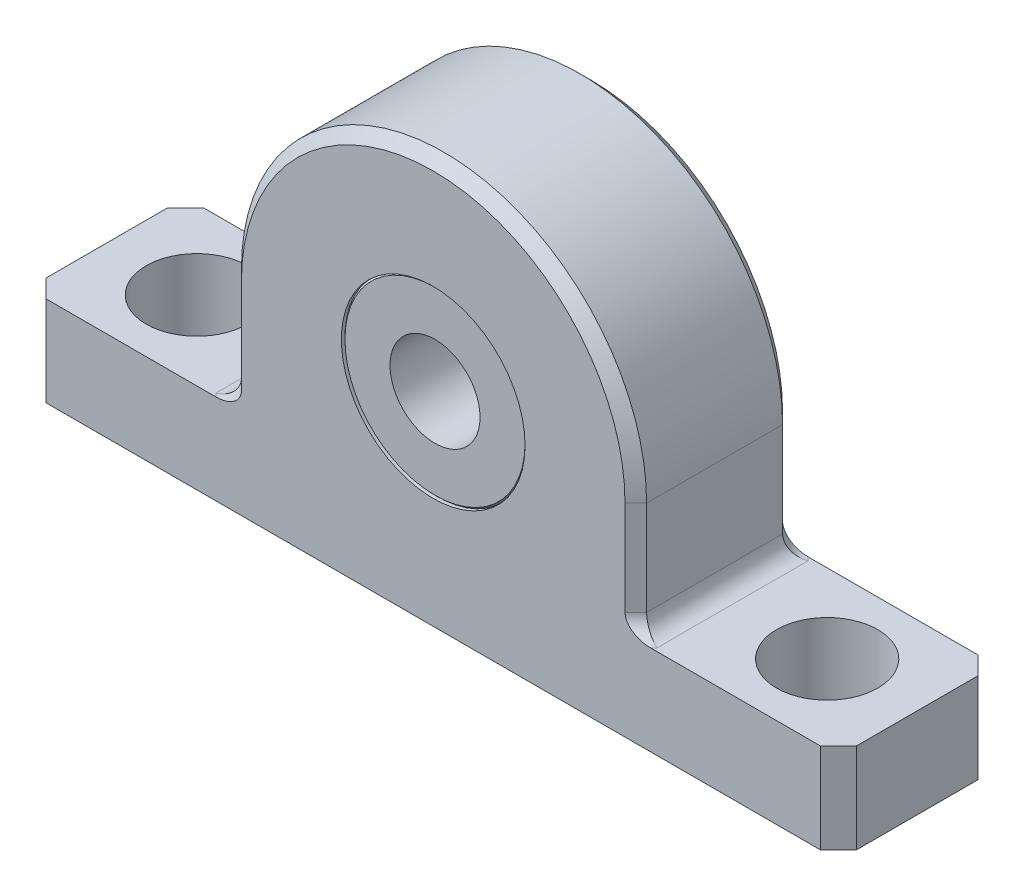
ISO-10303-21;
HEADER;
FILE_DESCRIPTION(('STEP AP214'),'2;1');
FILE_NAME('part.step','',(''),(''),'','','');
FILE_SCHEMA(('AUTOMOTIVE_DESIGN { 1 0 10303 214 1 1 1 1 }'));
ENDSEC;
DATA;
#1=APPLICATION_CONTEXT('core data for automotive mechanical design processes');
#2=APPLICATION_PROTOCOL_DEFINITION('international standard','automotive_design',2000,#1);
#3=PRODUCT_CONTEXT('',#1,'mechanical');
#4=PRODUCT('Part','Part','',(#3));
#5=PRODUCT_RELATED_PRODUCT_CATEGORY('part','',(#4));
#6=PRODUCT_DEFINITION_FORMATION('','',#4);
#7=PRODUCT_DEFINITION_CONTEXT('part definition',#1,'design');
#8=PRODUCT_DEFINITION('design','',#6,#7);
#9=PRODUCT_DEFINITION_SHAPE('','',#8);
#10=(LENGTH_UNIT() NAMED_UNIT(*) SI_UNIT(.MILLI.,.METRE.));
#11=(NAMED_UNIT(*) PLANE_ANGLE_UNIT() SI_UNIT($,.RADIAN.));
#12=(NAMED_UNIT(*) SI_UNIT($,.STERADIAN.) SOLID_ANGLE_UNIT());
#13=UNCERTAINTY_MEASURE_WITH_UNIT(LENGTH_MEASURE(1.E-05),#10,'distance_accuracy_value','');
#14=(GEOMETRIC_REPRESENTATION_CONTEXT(3) GLOBAL_UNCERTAINTY_ASSIGNED_CONTEXT((#13)) GLOBAL_UNIT_ASSIGNED_CONTEXT((#10,
#11,#12)) REPRESENTATION_CONTEXT('',''));
#15=CARTESIAN_POINT('',(0.,0.,0.));
#16=DIRECTION('',(0.,0.,1.));
#17=DIRECTION('',(1.,0.,0.));
#18=AXIS2_PLACEMENT_3D('',#15,#16,#17);
#19=CARTESIAN_POINT('',(0.,0.,-5.55625));
#20=DIRECTION('',(0.,0.,1.));
#21=DIRECTION('',(1.,0.,0.));
#22=AXIS2_PLACEMENT_3D('',#19,#20,#21);
#23=CYLINDRICAL_SURFACE('',#22,6.477);
#24=CARTESIAN_POINT('',(0.,0.,5.55625));
#25=DIRECTION('',(0.,0.,1.));
#26=DIRECTION('',(1.,0.,0.));
#27=AXIS2_PLACEMENT_3D('',#24,#25,#26);
#28=CIRCLE('',#27,6.477);
#29=CARTESIAN_POINT('',(6.477,0.,5.55625));
#30=VERTEX_POINT('',#29);
#31=EDGE_CURVE('E363',#30,#30,#28,.T.);
#32=ORIENTED_EDGE('',*,*,#31,.T.);
#33=EDGE_LOOP('',(#32));
#34=FACE_BOUND('',#33,.T.);
#35=CARTESIAN_POINT('',(0.,0.,5.30224999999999));
#36=DIRECTION('',(0.,0.,-1.));
#37=DIRECTION('',(0.,1.,0.));
#38=AXIS2_PLACEMENT_3D('',#35,#36,#37);
#39=CIRCLE('',#38,6.477);
#40=CARTESIAN_POINT('',(0.,6.477,5.30224999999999));
#41=VERTEX_POINT('',#40);
#42=EDGE_CURVE('E11',#41,#41,#39,.F.);
#43=ORIENTED_EDGE('',*,*,#42,.F.);
#44=EDGE_LOOP('',(#43));
#45=FACE_BOUND('',#44,.T.);
#46=ADVANCED_FACE('F33',(#34,#45),#23,.F.);
#47=CARTESIAN_POINT('',(0.,0.,-5.55625));
#48=DIRECTION('',(0.,0.,1.));
#49=DIRECTION('',(1.,0.,0.));
#50=AXIS2_PLACEMENT_3D('',#47,#48,#49);
#51=CIRCLE('',#50,6.477);
#52=CARTESIAN_POINT('',(6.477,0.,-5.55625));
#53=VERTEX_POINT('',#52);
#54=EDGE_CURVE('E366',#53,#53,#51,.T.);
#55=ORIENTED_EDGE('',*,*,#54,.F.);
#56=EDGE_LOOP('',(#55));
#57=FACE_BOUND('',#56,.T.);
#58=CARTESIAN_POINT('',(0.,0.,4.15925));
#59=DIRECTION('',(0.,0.,1.));
#60=DIRECTION('',(0.,-1.,0.));
#61=AXIS2_PLACEMENT_3D('',#58,#59,#60);
#62=CIRCLE('',#61,6.477);
#63=CARTESIAN_POINT('',(0.,-6.477,4.15925));
#64=VERTEX_POINT('',#63);
#65=EDGE_CURVE('E42',#64,#64,#62,.F.);
#66=ORIENTED_EDGE('',*,*,#65,.F.);
#67=EDGE_LOOP('',(#66));
#68=FACE_BOUND('',#67,.T.);
#69=ADVANCED_FACE('F437',(#57,#68),#23,.F.);
#70=CARTESIAN_POINT('',(0.,0.,5.55625));
#71=DIRECTION('',(0.,0.,-1.));
#72=DIRECTION('',(-1.,0.,0.));
#73=AXIS2_PLACEMENT_3D('',#70,#71,#72);
#74=CYLINDRICAL_SURFACE('',#73,14.2875);
#75=DIRECTION('',(0.,0.,-1.));
#76=VECTOR('',#75,1.);
#77=CARTESIAN_POINT('',(14.2875,0.,5.55625));
#78=LINE('',#77,#76);
#79=CARTESIAN_POINT('',(14.2875,0.,4.79424999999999));
#80=VERTEX_POINT('',#79);
#81=CARTESIAN_POINT('',(14.2875,0.,-4.79425));
#82=VERTEX_POINT('',#81);
#83=EDGE_CURVE('E240',#80,#82,#78,.T.);
#84=ORIENTED_EDGE('',*,*,#83,.T.);
#85=CARTESIAN_POINT('',(0.,0.,-4.79425));
#86=DIRECTION('',(0.,0.,1.));
#87=DIRECTION('',(1.,0.,0.));
#88=AXIS2_PLACEMENT_3D('',#85,#86,#87);
#89=CIRCLE('',#88,14.2875);
#90=CARTESIAN_POINT('',(-14.2875,0.,-4.79425));
#91=VERTEX_POINT('',#90);
#92=EDGE_CURVE('E193',#82,#91,#89,.T.);
#93=ORIENTED_EDGE('',*,*,#92,.T.);
#94=DIRECTION('',(0.,0.,-1.));
#95=VECTOR('',#94,1.);
#96=CARTESIAN_POINT('',(-14.2875,0.,5.55625));
#97=LINE('',#96,#95);
#98=CARTESIAN_POINT('',(-14.2875,0.,4.79424999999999));
#99=VERTEX_POINT('',#98);
#100=EDGE_CURVE('E178',#99,#91,#97,.T.);
#101=ORIENTED_EDGE('',*,*,#100,.F.);
#102=CARTESIAN_POINT('',(0.,0.,4.79424999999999));
#103=DIRECTION('',(0.,0.,1.));
#104=DIRECTION('',(1.,0.,0.));
#105=AXIS2_PLACEMENT_3D('',#102,#103,#104);
#106=CIRCLE('',#105,14.2875);
#107=EDGE_CURVE('E190',#99,#80,#106,.F.);
#108=ORIENTED_EDGE('',*,*,#107,.T.);
#109=EDGE_LOOP('',(#84,#93,#101,#108));
#110=FACE_BOUND('',#109,.T.);
#111=ADVANCED_FACE('F35',(#110),#74,.T.);
#112=CARTESIAN_POINT('',(-14.2875,0.,5.55625));
#113=DIRECTION('',(1.,0.,0.));
#114=DIRECTION('',(0.,1.,0.));
#115=AXIS2_PLACEMENT_3D('',#112,#113,#114);
#116=PLANE('',#115);
#117=DIRECTION('',(0.,-1.,0.));
#118=VECTOR('',#117,1.);
#119=CARTESIAN_POINT('',(-14.2875,0.,-4.79425));
#120=LINE('',#119,#118);
#121=CARTESIAN_POINT('',(-14.2875,-6.6675,-4.79425));
#122=VERTEX_POINT('',#121);
#123=EDGE_CURVE('E185',#91,#122,#120,.T.);
#124=ORIENTED_EDGE('',*,*,#123,.T.);
#125=DIRECTION('',(0.,0.,-1.));
#126=VECTOR('',#125,1.);
#127=CARTESIAN_POINT('',(-14.2875,-6.6675,4.79424999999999));
#128=LINE('',#127,#126);
#129=CARTESIAN_POINT('',(-14.2875,-6.6675,4.79424999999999));
#130=VERTEX_POINT('',#129);
#131=EDGE_CURVE('E181',#122,#130,#128,.F.);
#132=ORIENTED_EDGE('',*,*,#131,.T.);
#133=DIRECTION('',(0.,1.,0.));
#134=VECTOR('',#133,1.);
#135=CARTESIAN_POINT('',(-14.2875,0.,4.79424999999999));
#136=LINE('',#135,#134);
#137=EDGE_CURVE('E174',#130,#99,#136,.T.);
#138=ORIENTED_EDGE('',*,*,#137,.T.);
#139=ORIENTED_EDGE('',*,*,#100,.T.);
#140=EDGE_LOOP('',(#124,#132,#138,#139));
#141=FACE_BOUND('',#140,.T.);
#142=ADVANCED_FACE('F177',(#141),#116,.F.);
#143=CARTESIAN_POINT('',(-14.2875,-7.9375,5.55625));
#144=DIRECTION('',(0.,-1.,0.));
#145=DIRECTION('',(1.,0.,0.));
#146=AXIS2_PLACEMENT_3D('',#143,#144,#145);
#147=PLANE('',#146);
#148=CARTESIAN_POINT('',(-22.225,-7.9375,0.));
#149=DIRECTION('',(0.,-1.,0.));
#150=DIRECTION('',(1.,0.,0.));
#151=AXIS2_PLACEMENT_3D('',#148,#149,#150);
#152=CIRCLE('',#151,3.571875);
#153=CARTESIAN_POINT('',(-22.225,-7.9375,3.571875));
#154=VERTEX_POINT('',#153);
#155=EDGE_CURVE('E349',#154,#154,#152,.T.);
#156=ORIENTED_EDGE('',*,*,#155,.T.);
#157=EDGE_LOOP('',(#156));
#158=FACE_BOUND('',#157,.T.);
#159=DIRECTION('',(-1.,0.,0.));
#160=VECTOR('',#159,1.);
#161=CARTESIAN_POINT('',(-14.2875,-7.9375,-5.55625));
#162=LINE('',#161,#160);
#163=CARTESIAN_POINT('',(-15.3215512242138,-7.9375,-5.55625));
#164=VERTEX_POINT('',#163);
#165=CARTESIAN_POINT('',(-27.305,-7.9375,-5.55625));
#166=VERTEX_POINT('',#165);
#167=EDGE_CURVE('E224',#164,#166,#162,.T.);
#168=ORIENTED_EDGE('',*,*,#167,.T.);
#169=DIRECTION('',(0.707106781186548,0.,-0.707106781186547));
#170=VECTOR('',#169,1.);
#171=CARTESIAN_POINT('',(-28.575,-7.9375,-4.28625));
#172=LINE('',#171,#170);
#173=CARTESIAN_POINT('',(-28.575,-7.9375,-4.28625));
#174=VERTEX_POINT('',#173);
#175=EDGE_CURVE('E324',#166,#174,#172,.F.);
#176=ORIENTED_EDGE('',*,*,#175,.T.);
#177=DIRECTION('',(0.,0.,-1.));
#178=VECTOR('',#177,1.);
#179=CARTESIAN_POINT('',(-28.575,-7.9375,5.55625));
#180=LINE('',#179,#178);
#181=CARTESIAN_POINT('',(-28.575,-7.9375,4.28625));
#182=VERTEX_POINT('',#181);
#183=EDGE_CURVE('E194',#182,#174,#180,.T.);
#184=ORIENTED_EDGE('',*,*,#183,.F.);
#185=DIRECTION('',(0.707106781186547,0.,0.707106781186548));
#186=VECTOR('',#185,1.);
#187=CARTESIAN_POINT('',(-27.305,-7.9375,5.55625));
#188=LINE('',#187,#186);
#189=CARTESIAN_POINT('',(-27.305,-7.9375,5.55625));
#190=VERTEX_POINT('',#189);
#191=EDGE_CURVE('E322',#182,#190,#188,.T.);
#192=ORIENTED_EDGE('',*,*,#191,.T.);
#193=DIRECTION('',(-1.,0.,0.));
#194=VECTOR('',#193,1.);
#195=CARTESIAN_POINT('',(-14.2875,-7.9375,5.55625));
#196=LINE('',#195,#194);
#197=CARTESIAN_POINT('',(-15.3215512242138,-7.9375,5.55625));
#198=VERTEX_POINT('',#197);
#199=EDGE_CURVE('E232',#198,#190,#196,.T.);
#200=ORIENTED_EDGE('',*,*,#199,.F.);
#201=DIRECTION('',(-0.707106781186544,0.,-0.707106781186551));
#202=VECTOR('',#201,1.);
#203=CARTESIAN_POINT('',(-14.8045256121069,-7.9375,6.07327561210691));
#204=LINE('',#203,#202);
#205=CARTESIAN_POINT('',(-15.5575,-7.9375,5.32030122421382));
#206=VERTEX_POINT('',#205);
#207=EDGE_CURVE('E272',#198,#206,#204,.T.);
#208=ORIENTED_EDGE('',*,*,#207,.T.);
#209=DIRECTION('',(0.,0.,-1.));
#210=VECTOR('',#209,1.);
#211=CARTESIAN_POINT('',(-15.5575,-7.9375,-4.79425));
#212=LINE('',#211,#210);
#213=CARTESIAN_POINT('',(-15.5575,-7.9375,-5.32030122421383));
#214=VERTEX_POINT('',#213);
#215=EDGE_CURVE('E270',#206,#214,#212,.T.);
#216=ORIENTED_EDGE('',*,*,#215,.T.);
#217=DIRECTION('',(-0.707106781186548,0.,0.707106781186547));
#218=VECTOR('',#217,1.);
#219=CARTESIAN_POINT('',(-20.3607756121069,-7.9375,-0.517025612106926));
#220=LINE('',#219,#218);
#221=EDGE_CURVE('E274',#214,#164,#220,.F.);
#222=ORIENTED_EDGE('',*,*,#221,.T.);
#223=EDGE_LOOP('',(#168,#176,#184,#192,#200,#208,#216,#222));
#224=FACE_BOUND('',#223,.T.);
#225=ADVANCED_FACE('F717',(#158,#224),#147,.F.);
#226=CARTESIAN_POINT('',(-28.575,-7.9375,5.55625));
#227=DIRECTION('',(1.,0.,0.));
#228=DIRECTION('',(0.,1.,0.));
#229=AXIS2_PLACEMENT_3D('',#226,#227,#228);
#230=PLANE('',#229);
#231=ORIENTED_EDGE('',*,*,#183,.T.);
#232=DIRECTION('',(0.,-1.,0.));
#233=VECTOR('',#232,1.);
#234=CARTESIAN_POINT('',(-28.575,-7.9375,-4.28625));
#235=LINE('',#234,#233);
#236=CARTESIAN_POINT('',(-28.575,-14.2875,-4.28625));
#237=VERTEX_POINT('',#236);
#238=EDGE_CURVE('E307',#174,#237,#235,.T.);
#239=ORIENTED_EDGE('',*,*,#238,.T.);
#240=DIRECTION('',(0.,0.,-1.));
#241=VECTOR('',#240,1.);
#242=CARTESIAN_POINT('',(-28.575,-14.2875,5.55625));
#243=LINE('',#242,#241);
#244=CARTESIAN_POINT('',(-28.575,-14.2875,4.28625));
#245=VERTEX_POINT('',#244);
#246=EDGE_CURVE('E247',#245,#237,#243,.T.);
#247=ORIENTED_EDGE('',*,*,#246,.F.);
#248=DIRECTION('',(0.,1.,0.));
#249=VECTOR('',#248,1.);
#250=CARTESIAN_POINT('',(-28.575,-7.9375,4.28625));
#251=LINE('',#250,#249);
#252=EDGE_CURVE('E305',#245,#182,#251,.T.);
#253=ORIENTED_EDGE('',*,*,#252,.T.);
#254=EDGE_LOOP('',(#231,#239,#247,#253));
#255=FACE_BOUND('',#254,.T.);
#256=ADVANCED_FACE('F709',(#255),#230,.F.);
#257=CARTESIAN_POINT('',(-28.575,-14.2875,5.55625));
#258=DIRECTION('',(0.,1.,0.));
#259=DIRECTION('',(-1.,0.,0.));
#260=AXIS2_PLACEMENT_3D('',#257,#258,#259);
#261=PLANE('',#260);
#262=CARTESIAN_POINT('',(22.225,-14.2875,0.));
#263=DIRECTION('',(0.,1.,0.));
#264=DIRECTION('',(0.,0.,1.));
#265=AXIS2_PLACEMENT_3D('',#262,#263,#264);
#266=CIRCLE('',#265,3.571875);
#267=CARTESIAN_POINT('',(22.225,-14.2875,3.57187499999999));
#268=VERTEX_POINT('',#267);
#269=EDGE_CURVE('E772',#268,#268,#266,.T.);
#270=ORIENTED_EDGE('',*,*,#269,.T.);
#271=EDGE_LOOP('',(#270));
#272=FACE_BOUND('',#271,.T.);
#273=CARTESIAN_POINT('',(-22.225,-14.2875,0.));
#274=DIRECTION('',(0.,1.,0.));
#275=DIRECTION('',(0.,0.,1.));
#276=AXIS2_PLACEMENT_3D('',#273,#274,#275);
#277=CIRCLE('',#276,3.571875);
#278=CARTESIAN_POINT('',(-22.225,-14.2875,3.571875));
#279=VERTEX_POINT('',#278);
#280=EDGE_CURVE('E354',#279,#279,#277,.T.);
#281=ORIENTED_EDGE('',*,*,#280,.T.);
#282=EDGE_LOOP('',(#281));
#283=FACE_BOUND('',#282,.T.);
#284=ORIENTED_EDGE('',*,*,#246,.T.);
#285=DIRECTION('',(-0.707106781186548,0.,0.707106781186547));
#286=VECTOR('',#285,1.);
#287=CARTESIAN_POINT('',(-28.575,-14.2875,-4.28625));
#288=LINE('',#287,#286);
#289=CARTESIAN_POINT('',(-27.305,-14.2875,-5.55625));
#290=VERTEX_POINT('',#289);
#291=EDGE_CURVE('E316',#237,#290,#288,.F.);
#292=ORIENTED_EDGE('',*,*,#291,.T.);
#293=DIRECTION('',(1.,0.,0.));
#294=VECTOR('',#293,1.);
#295=CARTESIAN_POINT('',(-28.575,-14.2875,-5.55625));
#296=LINE('',#295,#294);
#297=CARTESIAN_POINT('',(27.305,-14.2875,-5.55625));
#298=VERTEX_POINT('',#297);
#299=EDGE_CURVE('E227',#290,#298,#296,.T.);
#300=ORIENTED_EDGE('',*,*,#299,.T.);
#301=DIRECTION('',(-0.707106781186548,0.,-0.707106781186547));
#302=VECTOR('',#301,1.);
#303=CARTESIAN_POINT('',(28.575,-14.2875,-4.28625));
#304=LINE('',#303,#302);
#305=CARTESIAN_POINT('',(28.575,-14.2875,-4.28625));
#306=VERTEX_POINT('',#305);
#307=EDGE_CURVE('E312',#298,#306,#304,.F.);
#308=ORIENTED_EDGE('',*,*,#307,.T.);
#309=DIRECTION('',(0.,0.,-1.));
#310=VECTOR('',#309,1.);
#311=CARTESIAN_POINT('',(28.575,-14.2875,5.55625));
#312=LINE('',#311,#310);
#313=CARTESIAN_POINT('',(28.575,-14.2875,4.28624999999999));
#314=VERTEX_POINT('',#313);
#315=EDGE_CURVE('E244',#314,#306,#312,.T.);
#316=ORIENTED_EDGE('',*,*,#315,.F.);
#317=DIRECTION('',(-0.707106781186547,0.,0.707106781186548));
#318=VECTOR('',#317,1.);
#319=CARTESIAN_POINT('',(27.305,-14.2875,5.55625));
#320=LINE('',#319,#318);
#321=CARTESIAN_POINT('',(27.305,-14.2875,5.55625));
#322=VERTEX_POINT('',#321);
#323=EDGE_CURVE('E310',#314,#322,#320,.T.);
#324=ORIENTED_EDGE('',*,*,#323,.T.);
#325=DIRECTION('',(1.,0.,0.));
#326=VECTOR('',#325,1.);
#327=CARTESIAN_POINT('',(-28.575,-14.2875,5.55625));
#328=LINE('',#327,#326);
#329=CARTESIAN_POINT('',(-27.305,-14.2875,5.55625));
#330=VERTEX_POINT('',#329);
#331=EDGE_CURVE('E235',#330,#322,#328,.T.);
#332=ORIENTED_EDGE('',*,*,#331,.F.);
#333=DIRECTION('',(-0.707106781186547,0.,-0.707106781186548));
#334=VECTOR('',#333,1.);
#335=CARTESIAN_POINT('',(-27.305,-14.2875,5.55624999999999));
#336=LINE('',#335,#334);
#337=EDGE_CURVE('E314',#330,#245,#336,.T.);
#338=ORIENTED_EDGE('',*,*,#337,.T.);
#339=EDGE_LOOP('',(#284,#292,#300,#308,#316,#324,#332,#338));
#340=FACE_BOUND('',#339,.T.);
#341=ADVANCED_FACE('F701',(#272,#283,#340),#261,.F.);
#342=CARTESIAN_POINT('',(28.575,-14.2875,5.55625));
#343=DIRECTION('',(-1.,0.,0.));
#344=DIRECTION('',(0.,0.,1.));
#345=AXIS2_PLACEMENT_3D('',#342,#343,#344);
#346=PLANE('',#345);
#347=ORIENTED_EDGE('',*,*,#315,.T.);
#348=DIRECTION('',(0.,1.,0.));
#349=VECTOR('',#348,1.);
#350=CARTESIAN_POINT('',(28.575,-14.2875,-4.28625));
#351=LINE('',#350,#349);
#352=CARTESIAN_POINT('',(28.575,-7.93749999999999,-4.28625));
#353=VERTEX_POINT('',#352);
#354=EDGE_CURVE('E334',#306,#353,#351,.T.);
#355=ORIENTED_EDGE('',*,*,#354,.T.);
#356=DIRECTION('',(0.,0.,-1.));
#357=VECTOR('',#356,1.);
#358=CARTESIAN_POINT('',(28.575,-7.93749999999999,5.55625));
#359=LINE('',#358,#357);
#360=CARTESIAN_POINT('',(28.575,-7.93749999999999,4.28625));
#361=VERTEX_POINT('',#360);
#362=EDGE_CURVE('E242',#361,#353,#359,.T.);
#363=ORIENTED_EDGE('',*,*,#362,.F.);
#364=DIRECTION('',(0.,-1.,0.));
#365=VECTOR('',#364,1.);
#366=CARTESIAN_POINT('',(28.575,-14.2875,4.28625));
#367=LINE('',#366,#365);
#368=EDGE_CURVE('E332',#361,#314,#367,.T.);
#369=ORIENTED_EDGE('',*,*,#368,.T.);
#370=EDGE_LOOP('',(#347,#355,#363,#369));
#371=FACE_BOUND('',#370,.T.);
#372=ADVANCED_FACE('F692',(#371),#346,.F.);
#373=CARTESIAN_POINT('',(28.575,-7.93749999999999,5.55625));
#374=DIRECTION('',(0.,-1.,0.));
#375=DIRECTION('',(1.,0.,0.));
#376=AXIS2_PLACEMENT_3D('',#373,#374,#375);
#377=PLANE('',#376);
#378=CARTESIAN_POINT('',(22.225,-7.9375,0.));
#379=DIRECTION('',(0.,-1.,0.));
#380=DIRECTION('',(1.,0.,0.));
#381=AXIS2_PLACEMENT_3D('',#378,#379,#380);
#382=CIRCLE('',#381,3.571875);
#383=CARTESIAN_POINT('',(22.225,-7.9375,3.57187499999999));
#384=VERTEX_POINT('',#383);
#385=EDGE_CURVE('E37',#384,#384,#382,.T.);
#386=ORIENTED_EDGE('',*,*,#385,.T.);
#387=EDGE_LOOP('',(#386));
#388=FACE_BOUND('',#387,.T.);
#389=ORIENTED_EDGE('',*,*,#362,.T.);
#390=DIRECTION('',(0.707106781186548,0.,0.707106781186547));
#391=VECTOR('',#390,1.);
#392=CARTESIAN_POINT('',(28.575,-7.93749999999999,-4.28625));
#393=LINE('',#392,#391);
#394=CARTESIAN_POINT('',(27.305,-7.93749999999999,-5.55625));
#395=VERTEX_POINT('',#394);
#396=EDGE_CURVE('E50',#353,#395,#393,.F.);
#397=ORIENTED_EDGE('',*,*,#396,.T.);
#398=DIRECTION('',(-1.,0.,0.));
#399=VECTOR('',#398,1.);
#400=CARTESIAN_POINT('',(28.575,-7.93749999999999,-5.55625));
#401=LINE('',#400,#399);
#402=CARTESIAN_POINT('',(15.3215512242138,-7.9375,-5.55625));
#403=VERTEX_POINT('',#402);
#404=EDGE_CURVE('E230',#395,#403,#401,.T.);
#405=ORIENTED_EDGE('',*,*,#404,.T.);
#406=DIRECTION('',(-0.707106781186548,0.,-0.707106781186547));
#407=VECTOR('',#406,1.);
#408=CARTESIAN_POINT('',(27.5045256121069,-7.93749999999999,6.62672438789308));
#409=LINE('',#408,#407);
#410=CARTESIAN_POINT('',(15.5575,-7.9375,-5.32030122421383));
#411=VERTEX_POINT('',#410);
#412=EDGE_CURVE('E287',#403,#411,#409,.F.);
#413=ORIENTED_EDGE('',*,*,#412,.T.);
#414=DIRECTION('',(0.,0.,-1.));
#415=VECTOR('',#414,1.);
#416=CARTESIAN_POINT('',(15.5575,-7.9375,4.79424999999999));
#417=LINE('',#416,#415);
#418=CARTESIAN_POINT('',(15.5575,-7.9375,5.32030122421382));
#419=VERTEX_POINT('',#418);
#420=EDGE_CURVE('E282',#411,#419,#417,.F.);
#421=ORIENTED_EDGE('',*,*,#420,.T.);
#422=DIRECTION('',(-0.707106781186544,0.,0.707106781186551));
#423=VECTOR('',#422,1.);
#424=CARTESIAN_POINT('',(21.9482756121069,-7.9375,-1.07047438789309));
#425=LINE('',#424,#423);
#426=CARTESIAN_POINT('',(15.3215512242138,-7.9375,5.55625));
#427=VERTEX_POINT('',#426);
#428=EDGE_CURVE('E284',#419,#427,#425,.T.);
#429=ORIENTED_EDGE('',*,*,#428,.T.);
#430=DIRECTION('',(-1.,0.,0.));
#431=VECTOR('',#430,1.);
#432=CARTESIAN_POINT('',(28.575,-7.93749999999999,5.55625));
#433=LINE('',#432,#431);
#434=CARTESIAN_POINT('',(27.305,-7.93749999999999,5.55625));
#435=VERTEX_POINT('',#434);
#436=EDGE_CURVE('E238',#435,#427,#433,.T.);
#437=ORIENTED_EDGE('',*,*,#436,.F.);
#438=DIRECTION('',(0.707106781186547,0.,-0.707106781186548));
#439=VECTOR('',#438,1.);
#440=CARTESIAN_POINT('',(27.305,-7.93749999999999,5.55625));
#441=LINE('',#440,#439);
#442=EDGE_CURVE('E58',#435,#361,#441,.T.);
#443=ORIENTED_EDGE('',*,*,#442,.T.);
#444=EDGE_LOOP('',(#389,#397,#405,#413,#421,#429,#437,#443));
#445=FACE_BOUND('',#444,.T.);
#446=ADVANCED_FACE('F685',(#388,#445),#377,.F.);
#447=CARTESIAN_POINT('',(14.2875,-7.9375,5.55625));
#448=DIRECTION('',(-1.,0.,0.));
#449=DIRECTION('',(0.,-1.,0.));
#450=AXIS2_PLACEMENT_3D('',#447,#448,#449);
#451=PLANE('',#450);
#452=DIRECTION('',(0.,-1.,0.));
#453=VECTOR('',#452,1.);
#454=CARTESIAN_POINT('',(14.2875,-7.9375,4.79424999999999));
#455=LINE('',#454,#453);
#456=CARTESIAN_POINT('',(14.2875,-6.6675,4.79424999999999));
#457=VERTEX_POINT('',#456);
#458=EDGE_CURVE('E260',#80,#457,#455,.T.);
#459=ORIENTED_EDGE('',*,*,#458,.T.);
#460=DIRECTION('',(0.,0.,-1.));
#461=VECTOR('',#460,1.);
#462=CARTESIAN_POINT('',(14.2875,-6.6675,-4.79425));
#463=LINE('',#462,#461);
#464=CARTESIAN_POINT('',(14.2875,-6.6675,-4.79425));
#465=VERTEX_POINT('',#464);
#466=EDGE_CURVE('E294',#457,#465,#463,.T.);
#467=ORIENTED_EDGE('',*,*,#466,.T.);
#468=DIRECTION('',(0.,1.,0.));
#469=VECTOR('',#468,1.);
#470=CARTESIAN_POINT('',(14.2875,-7.9375,-4.79425));
#471=LINE('',#470,#469);
#472=EDGE_CURVE('E263',#465,#82,#471,.T.);
#473=ORIENTED_EDGE('',*,*,#472,.T.);
#474=ORIENTED_EDGE('',*,*,#83,.F.);
#475=EDGE_LOOP('',(#459,#467,#473,#474));
#476=FACE_BOUND('',#475,.T.);
#477=ADVANCED_FACE('F398',(#476),#451,.F.);
#478=CARTESIAN_POINT('',(0.,0.,5.55625));
#479=DIRECTION('',(0.,0.,1.));
#480=DIRECTION('',(1.,0.,0.));
#481=AXIS2_PLACEMENT_3D('',#478,#479,#480);
#482=PLANE('',#481);
#483=ORIENTED_EDGE('',*,*,#31,.F.);
#484=EDGE_LOOP('',(#483));
#485=FACE_BOUND('',#484,.T.);
#486=ORIENTED_EDGE('',*,*,#199,.T.);
#487=DIRECTION('',(0.,-1.,0.));
#488=VECTOR('',#487,1.);
#489=CARTESIAN_POINT('',(-27.305,-14.2875,5.55625));
#490=LINE('',#489,#488);
#491=EDGE_CURVE('E329',#190,#330,#490,.T.);
#492=ORIENTED_EDGE('',*,*,#491,.T.);
#493=ORIENTED_EDGE('',*,*,#331,.T.);
#494=DIRECTION('',(0.,1.,0.));
#495=VECTOR('',#494,1.);
#496=CARTESIAN_POINT('',(27.305,-7.93749999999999,5.55625));
#497=LINE('',#496,#495);
#498=EDGE_CURVE('E326',#322,#435,#497,.T.);
#499=ORIENTED_EDGE('',*,*,#498,.T.);
#500=ORIENTED_EDGE('',*,*,#436,.T.);
#501=CARTESIAN_POINT('',(15.3215512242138,-6.6675,5.55625));
#502=DIRECTION('',(0.,0.,1.));
#503=DIRECTION('',(-1.,0.,0.));
#504=AXIS2_PLACEMENT_3D('',#501,#502,#503);
#505=ELLIPSE('',#504,1.79605122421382,1.27);
#506=CARTESIAN_POINT('',(13.5255,-6.6675,5.55625));
#507=VERTEX_POINT('',#506);
#508=EDGE_CURVE('E303',#427,#507,#505,.F.);
#509=ORIENTED_EDGE('',*,*,#508,.T.);
#510=DIRECTION('',(0.,1.,0.));
#511=VECTOR('',#510,1.);
#512=CARTESIAN_POINT('',(13.5255,0.,5.55625));
#513=LINE('',#512,#511);
#514=CARTESIAN_POINT('',(13.5255,0.,5.55625));
#515=VERTEX_POINT('',#514);
#516=EDGE_CURVE('E267',#507,#515,#513,.T.);
#517=ORIENTED_EDGE('',*,*,#516,.T.);
#518=CARTESIAN_POINT('',(0.,0.,5.55625));
#519=DIRECTION('',(0.,0.,1.));
#520=DIRECTION('',(1.,0.,0.));
#521=AXIS2_PLACEMENT_3D('',#518,#519,#520);
#522=CIRCLE('',#521,13.5255);
#523=CARTESIAN_POINT('',(-13.5255,0.,5.55625));
#524=VERTEX_POINT('',#523);
#525=EDGE_CURVE('E265',#515,#524,#522,.T.);
#526=ORIENTED_EDGE('',*,*,#525,.T.);
#527=DIRECTION('',(0.,-1.,0.));
#528=VECTOR('',#527,1.);
#529=CARTESIAN_POINT('',(-13.5255,-7.9375,5.55625));
#530=LINE('',#529,#528);
#531=CARTESIAN_POINT('',(-13.5255,-6.6675,5.55625));
#532=VERTEX_POINT('',#531);
#533=EDGE_CURVE('E209',#524,#532,#530,.T.);
#534=ORIENTED_EDGE('',*,*,#533,.T.);
#535=CARTESIAN_POINT('',(-15.3215512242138,-6.6675,5.55625));
#536=DIRECTION('',(0.,0.,1.));
#537=DIRECTION('',(-1.,0.,0.));
#538=AXIS2_PLACEMENT_3D('',#535,#536,#537);
#539=ELLIPSE('',#538,1.79605122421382,1.27);
#540=EDGE_CURVE('E298',#532,#198,#539,.F.);
#541=ORIENTED_EDGE('',*,*,#540,.T.);
#542=EDGE_LOOP('',(#486,#492,#493,#499,#500,#509,#517,#526,#534,#541));
#543=FACE_BOUND('',#542,.T.);
#544=ADVANCED_FACE('F388',(#485,#543),#482,.T.);
#545=CARTESIAN_POINT('',(0.,0.,-5.55625));
#546=DIRECTION('',(0.,0.,1.));
#547=DIRECTION('',(1.,0.,0.));
#548=AXIS2_PLACEMENT_3D('',#545,#546,#547);
#549=PLANE('',#548);
#550=ORIENTED_EDGE('',*,*,#54,.T.);
#551=EDGE_LOOP('',(#550));
#552=FACE_BOUND('',#551,.T.);
#553=ORIENTED_EDGE('',*,*,#299,.F.);
#554=DIRECTION('',(0.,1.,0.));
#555=VECTOR('',#554,1.);
#556=CARTESIAN_POINT('',(-27.305,0.,-5.55625));
#557=LINE('',#556,#555);
#558=EDGE_CURVE('E320',#290,#166,#557,.T.);
#559=ORIENTED_EDGE('',*,*,#558,.T.);
#560=ORIENTED_EDGE('',*,*,#167,.F.);
#561=CARTESIAN_POINT('',(-15.3215512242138,-6.6675,-5.55625));
#562=DIRECTION('',(0.,0.,1.));
#563=DIRECTION('',(-1.,0.,0.));
#564=AXIS2_PLACEMENT_3D('',#561,#562,#563);
#565=ELLIPSE('',#564,1.79605122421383,1.27);
#566=CARTESIAN_POINT('',(-13.5255,-6.6675,-5.55625));
#567=VERTEX_POINT('',#566);
#568=EDGE_CURVE('E296',#164,#567,#565,.T.);
#569=ORIENTED_EDGE('',*,*,#568,.T.);
#570=DIRECTION('',(0.,1.,0.));
#571=VECTOR('',#570,1.);
#572=CARTESIAN_POINT('',(-13.5255,0.,-5.55625));
#573=LINE('',#572,#571);
#574=CARTESIAN_POINT('',(-13.5255,0.,-5.55625));
#575=VERTEX_POINT('',#574);
#576=EDGE_CURVE('E205',#567,#575,#573,.T.);
#577=ORIENTED_EDGE('',*,*,#576,.T.);
#578=CARTESIAN_POINT('',(0.,0.,-5.55625));
#579=DIRECTION('',(0.,0.,1.));
#580=DIRECTION('',(1.,0.,0.));
#581=AXIS2_PLACEMENT_3D('',#578,#579,#580);
#582=CIRCLE('',#581,13.5255);
#583=CARTESIAN_POINT('',(13.5255,0.,-5.55625));
#584=VERTEX_POINT('',#583);
#585=EDGE_CURVE('E256',#575,#584,#582,.F.);
#586=ORIENTED_EDGE('',*,*,#585,.T.);
#587=DIRECTION('',(0.,-1.,0.));
#588=VECTOR('',#587,1.);
#589=CARTESIAN_POINT('',(13.5255,0.,-5.55625));
#590=LINE('',#589,#588);
#591=CARTESIAN_POINT('',(13.5255,-6.6675,-5.55625));
#592=VERTEX_POINT('',#591);
#593=EDGE_CURVE('E253',#584,#592,#590,.T.);
#594=ORIENTED_EDGE('',*,*,#593,.T.);
#595=CARTESIAN_POINT('',(15.3215512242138,-6.6675,-5.55625));
#596=DIRECTION('',(0.,0.,1.));
#597=DIRECTION('',(-1.,0.,0.));
#598=AXIS2_PLACEMENT_3D('',#595,#596,#597);
#599=ELLIPSE('',#598,1.79605122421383,1.27);
#600=EDGE_CURVE('E300',#592,#403,#599,.T.);
#601=ORIENTED_EDGE('',*,*,#600,.T.);
#602=ORIENTED_EDGE('',*,*,#404,.F.);
#603=DIRECTION('',(0.,-1.,0.));
#604=VECTOR('',#603,1.);
#605=CARTESIAN_POINT('',(27.305,0.,-5.55625));
#606=LINE('',#605,#604);
#607=EDGE_CURVE('E318',#395,#298,#606,.T.);
#608=ORIENTED_EDGE('',*,*,#607,.T.);
#609=EDGE_LOOP('',(#553,#559,#560,#569,#577,#586,#594,#601,#602,#608));
#610=FACE_BOUND('',#609,.T.);
#611=ADVANCED_FACE('F419',(#552,#610),#549,.F.);
#612=CARTESIAN_POINT('',(14.2875,-7.9375,-4.79425));
#613=DIRECTION('',(-0.707106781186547,0.,0.707106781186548));
#614=DIRECTION('',(0.707106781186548,0.,0.707106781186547));
#615=AXIS2_PLACEMENT_3D('',#612,#613,#614);
#616=PLANE('',#615);
#617=ORIENTED_EDGE('',*,*,#472,.F.);
#618=DIRECTION('',(0.707106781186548,0.,0.707106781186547));
#619=VECTOR('',#618,1.);
#620=CARTESIAN_POINT('',(14.2875,-6.6675,-4.79425));
#621=LINE('',#620,#619);
#622=EDGE_CURVE('E290',#465,#592,#621,.F.);
#623=ORIENTED_EDGE('',*,*,#622,.T.);
#624=ORIENTED_EDGE('',*,*,#593,.F.);
#625=DIRECTION('',(-0.707106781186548,0.,-0.707106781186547));
#626=VECTOR('',#625,1.);
#627=CARTESIAN_POINT('',(14.2875,0.,-4.79425));
#628=LINE('',#627,#626);
#629=EDGE_CURVE('E221',#82,#584,#628,.T.);
#630=ORIENTED_EDGE('',*,*,#629,.F.);
#631=EDGE_LOOP('',(#617,#623,#624,#630));
#632=FACE_BOUND('',#631,.T.);
#633=ADVANCED_FACE('F415',(#632),#616,.F.);
#634=CARTESIAN_POINT('',(0.,0.,-4.79425));
#635=DIRECTION('',(0.,0.,1.));
#636=DIRECTION('',(1.,0.,0.));
#637=AXIS2_PLACEMENT_3D('',#634,#635,#636);
#638=CONICAL_SURFACE('',#637,14.2875,0.785398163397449);
#639=ORIENTED_EDGE('',*,*,#629,.T.);
#640=ORIENTED_EDGE('',*,*,#585,.F.);
#641=DIRECTION('',(0.707106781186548,0.,-0.707106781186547));
#642=VECTOR('',#641,1.);
#643=CARTESIAN_POINT('',(-14.2875,0.,-4.79425));
#644=LINE('',#643,#642);
#645=EDGE_CURVE('E212',#91,#575,#644,.T.);
#646=ORIENTED_EDGE('',*,*,#645,.F.);
#647=ORIENTED_EDGE('',*,*,#92,.F.);
#648=EDGE_LOOP('',(#639,#640,#646,#647));
#649=FACE_BOUND('',#648,.T.);
#650=ADVANCED_FACE('F424',(#649),#638,.T.);
#651=CARTESIAN_POINT('',(-14.2875,0.,-4.79425));
#652=DIRECTION('',(0.707106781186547,0.,0.707106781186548));
#653=DIRECTION('',(0.707106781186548,0.,-0.707106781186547));
#654=AXIS2_PLACEMENT_3D('',#651,#652,#653);
#655=PLANE('',#654);
#656=ORIENTED_EDGE('',*,*,#576,.F.);
#657=DIRECTION('',(0.707106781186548,0.,-0.707106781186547));
#658=VECTOR('',#657,1.);
#659=CARTESIAN_POINT('',(-14.2875,-6.6675,-4.79425));
#660=LINE('',#659,#658);
#661=EDGE_CURVE('E277',#567,#122,#660,.F.);
#662=ORIENTED_EDGE('',*,*,#661,.T.);
#663=ORIENTED_EDGE('',*,*,#123,.F.);
#664=ORIENTED_EDGE('',*,*,#645,.T.);
#665=EDGE_LOOP('',(#656,#662,#663,#664));
#666=FACE_BOUND('',#665,.T.);
#667=ADVANCED_FACE('F427',(#666),#655,.F.);
#668=CARTESIAN_POINT('',(13.5255,0.,5.55625));
#669=DIRECTION('',(0.707106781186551,0.,0.707106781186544));
#670=DIRECTION('',(0.707106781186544,0.,-0.707106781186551));
#671=AXIS2_PLACEMENT_3D('',#668,#669,#670);
#672=PLANE('',#671);
#673=ORIENTED_EDGE('',*,*,#516,.F.);
#674=DIRECTION('',(-0.707106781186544,0.,0.707106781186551));
#675=VECTOR('',#674,1.);
#676=CARTESIAN_POINT('',(13.5255,-6.6675,5.55625));
#677=LINE('',#676,#675);
#678=EDGE_CURVE('E292',#507,#457,#677,.F.);
#679=ORIENTED_EDGE('',*,*,#678,.T.);
#680=ORIENTED_EDGE('',*,*,#458,.F.);
#681=DIRECTION('',(0.707106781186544,0.,-0.707106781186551));
#682=VECTOR('',#681,1.);
#683=CARTESIAN_POINT('',(13.5255,0.,5.55625));
#684=LINE('',#683,#682);
#685=EDGE_CURVE('E204',#515,#80,#684,.T.);
#686=ORIENTED_EDGE('',*,*,#685,.F.);
#687=EDGE_LOOP('',(#673,#679,#680,#686));
#688=FACE_BOUND('',#687,.T.);
#689=ADVANCED_FACE('F395',(#688),#672,.T.);
#690=CARTESIAN_POINT('',(0.,0.,5.55625));
#691=DIRECTION('',(0.,0.,-1.));
#692=DIRECTION('',(-1.,0.,0.));
#693=AXIS2_PLACEMENT_3D('',#690,#691,#692);
#694=CONICAL_SURFACE('',#693,13.5255,0.785398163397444);
#695=ORIENTED_EDGE('',*,*,#685,.T.);
#696=ORIENTED_EDGE('',*,*,#107,.F.);
#697=DIRECTION('',(-0.707106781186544,0.,-0.707106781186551));
#698=VECTOR('',#697,1.);
#699=CARTESIAN_POINT('',(-13.5255,0.,5.55625));
#700=LINE('',#699,#698);
#701=EDGE_CURVE('E201',#524,#99,#700,.T.);
#702=ORIENTED_EDGE('',*,*,#701,.F.);
#703=ORIENTED_EDGE('',*,*,#525,.F.);
#704=EDGE_LOOP('',(#695,#696,#702,#703));
#705=FACE_BOUND('',#704,.T.);
#706=ADVANCED_FACE('F199',(#705),#694,.T.);
#707=CARTESIAN_POINT('',(-13.5255,0.,5.55625));
#708=DIRECTION('',(-0.707106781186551,0.,0.707106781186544));
#709=DIRECTION('',(0.707106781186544,0.,0.707106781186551));
#710=AXIS2_PLACEMENT_3D('',#707,#708,#709);
#711=PLANE('',#710);
#712=ORIENTED_EDGE('',*,*,#137,.F.);
#713=DIRECTION('',(-0.707106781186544,0.,-0.707106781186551));
#714=VECTOR('',#713,1.);
#715=CARTESIAN_POINT('',(-13.5255,-6.6675,5.55625));
#716=LINE('',#715,#714);
#717=EDGE_CURVE('E279',#130,#532,#716,.F.);
#718=ORIENTED_EDGE('',*,*,#717,.T.);
#719=ORIENTED_EDGE('',*,*,#533,.F.);
#720=ORIENTED_EDGE('',*,*,#701,.T.);
#721=EDGE_LOOP('',(#712,#718,#719,#720));
#722=FACE_BOUND('',#721,.T.);
#723=ADVANCED_FACE('F207',(#722),#711,.T.);
#724=CARTESIAN_POINT('',(-14.8045256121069,-6.6675,6.07327561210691));
#725=DIRECTION('',(-0.707106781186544,0.,-0.707106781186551));
#726=DIRECTION('',(-0.707106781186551,0.,0.707106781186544));
#727=AXIS2_PLACEMENT_3D('',#724,#725,#726);
#728=CYLINDRICAL_SURFACE('',#727,1.27);
#729=ORIENTED_EDGE('',*,*,#540,.F.);
#730=ORIENTED_EDGE('',*,*,#717,.F.);
#731=CARTESIAN_POINT('',(-15.5575,-6.6675,5.32030122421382));
#732=DIRECTION('',(0.382683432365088,0.,0.923879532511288));
#733=DIRECTION('',(-0.923879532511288,0.,0.382683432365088));
#734=AXIS2_PLACEMENT_3D('',#731,#732,#733);
#735=ELLIPSE('',#734,1.37463809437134,1.27);
#736=EDGE_CURVE('E210',#206,#130,#735,.T.);
#737=ORIENTED_EDGE('',*,*,#736,.F.);
#738=ORIENTED_EDGE('',*,*,#207,.F.);
#739=EDGE_LOOP('',(#729,#730,#737,#738));
#740=FACE_BOUND('',#739,.T.);
#741=ADVANCED_FACE('F386',(#740),#728,.F.);
#742=CARTESIAN_POINT('',(-15.5575,-6.6675,5.55625));
#743=DIRECTION('',(0.,0.,1.));
#744=DIRECTION('',(1.,0.,0.));
#745=AXIS2_PLACEMENT_3D('',#742,#743,#744);
#746=CYLINDRICAL_SURFACE('',#745,1.27);
#747=ORIENTED_EDGE('',*,*,#736,.T.);
#748=ORIENTED_EDGE('',*,*,#131,.F.);
#749=CARTESIAN_POINT('',(-15.5575,-6.6675,-5.32030122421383));
#750=DIRECTION('',(-0.38268343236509,0.,0.923879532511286));
#751=DIRECTION('',(0.923879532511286,0.,0.38268343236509));
#752=AXIS2_PLACEMENT_3D('',#749,#750,#751);
#753=ELLIPSE('',#752,1.37463809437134,1.27);
#754=EDGE_CURVE('E215',#214,#122,#753,.T.);
#755=ORIENTED_EDGE('',*,*,#754,.F.);
#756=ORIENTED_EDGE('',*,*,#215,.F.);
#757=EDGE_LOOP('',(#747,#748,#755,#756));
#758=FACE_BOUND('',#757,.T.);
#759=ADVANCED_FACE('F381',(#758),#746,.F.);
#760=CARTESIAN_POINT('',(-20.3607756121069,-6.6675,-0.517025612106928));
#761=DIRECTION('',(-0.707106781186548,0.,0.707106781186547));
#762=DIRECTION('',(0.707106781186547,0.,0.707106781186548));
#763=AXIS2_PLACEMENT_3D('',#760,#761,#762);
#764=CYLINDRICAL_SURFACE('',#763,1.27);
#765=ORIENTED_EDGE('',*,*,#754,.T.);
#766=ORIENTED_EDGE('',*,*,#661,.F.);
#767=ORIENTED_EDGE('',*,*,#568,.F.);
#768=ORIENTED_EDGE('',*,*,#221,.F.);
#769=EDGE_LOOP('',(#765,#766,#767,#768));
#770=FACE_BOUND('',#769,.T.);
#771=ADVANCED_FACE('F378',(#770),#764,.F.);
#772=CARTESIAN_POINT('',(21.9482756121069,-6.6675,-1.07047438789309));
#773=DIRECTION('',(-0.707106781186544,0.,0.707106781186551));
#774=DIRECTION('',(0.707106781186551,0.,0.707106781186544));
#775=AXIS2_PLACEMENT_3D('',#772,#773,#774);
#776=CYLINDRICAL_SURFACE('',#775,1.27);
#777=ORIENTED_EDGE('',*,*,#508,.F.);
#778=ORIENTED_EDGE('',*,*,#428,.F.);
#779=CARTESIAN_POINT('',(15.5575,-6.6675,5.32030122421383));
#780=DIRECTION('',(-0.382683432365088,0.,0.923879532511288));
#781=DIRECTION('',(0.923879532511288,0.,0.382683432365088));
#782=AXIS2_PLACEMENT_3D('',#779,#780,#781);
#783=ELLIPSE('',#782,1.37463809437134,1.27);
#784=EDGE_CURVE('E371',#457,#419,#783,.T.);
#785=ORIENTED_EDGE('',*,*,#784,.F.);
#786=ORIENTED_EDGE('',*,*,#678,.F.);
#787=EDGE_LOOP('',(#777,#778,#785,#786));
#788=FACE_BOUND('',#787,.T.);
#789=ADVANCED_FACE('F403',(#788),#776,.F.);
#790=CARTESIAN_POINT('',(15.5575,-6.6675,5.55625));
#791=DIRECTION('',(0.,0.,1.));
#792=DIRECTION('',(1.,0.,0.));
#793=AXIS2_PLACEMENT_3D('',#790,#791,#792);
#794=CYLINDRICAL_SURFACE('',#793,1.27);
#795=ORIENTED_EDGE('',*,*,#784,.T.);
#796=ORIENTED_EDGE('',*,*,#420,.F.);
#797=CARTESIAN_POINT('',(15.5575,-6.6675,-5.32030122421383));
#798=DIRECTION('',(0.38268343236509,0.,0.923879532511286));
#799=DIRECTION('',(-0.923879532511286,0.,0.38268343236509));
#800=AXIS2_PLACEMENT_3D('',#797,#798,#799);
#801=ELLIPSE('',#800,1.37463809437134,1.27);
#802=EDGE_CURVE('E369',#465,#411,#801,.T.);
#803=ORIENTED_EDGE('',*,*,#802,.F.);
#804=ORIENTED_EDGE('',*,*,#466,.F.);
#805=EDGE_LOOP('',(#795,#796,#803,#804));
#806=FACE_BOUND('',#805,.T.);
#807=ADVANCED_FACE('F407',(#806),#794,.F.);
#808=CARTESIAN_POINT('',(27.5045256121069,-6.66749999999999,6.62672438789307));
#809=DIRECTION('',(-0.707106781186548,0.,-0.707106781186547));
#810=DIRECTION('',(-0.707106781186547,0.,0.707106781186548));
#811=AXIS2_PLACEMENT_3D('',#808,#809,#810);
#812=CYLINDRICAL_SURFACE('',#811,1.27);
#813=ORIENTED_EDGE('',*,*,#600,.F.);
#814=ORIENTED_EDGE('',*,*,#622,.F.);
#815=ORIENTED_EDGE('',*,*,#802,.T.);
#816=ORIENTED_EDGE('',*,*,#412,.F.);
#817=EDGE_LOOP('',(#813,#814,#815,#816));
#818=FACE_BOUND('',#817,.T.);
#819=ADVANCED_FACE('F412',(#818),#812,.F.);
#820=CARTESIAN_POINT('',(-28.575,-7.9375,-4.28625));
#821=DIRECTION('',(0.707106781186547,0.,0.707106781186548));
#822=DIRECTION('',(0.707106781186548,0.,-0.707106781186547));
#823=AXIS2_PLACEMENT_3D('',#820,#821,#822);
#824=PLANE('',#823);
#825=ORIENTED_EDGE('',*,*,#175,.F.);
#826=ORIENTED_EDGE('',*,*,#558,.F.);
#827=ORIENTED_EDGE('',*,*,#291,.F.);
#828=ORIENTED_EDGE('',*,*,#238,.F.);
#829=EDGE_LOOP('',(#825,#826,#827,#828));
#830=FACE_BOUND('',#829,.T.);
#831=ADVANCED_FACE('F460',(#830),#824,.F.);
#832=CARTESIAN_POINT('',(-27.305,0.,5.55625));
#833=DIRECTION('',(-0.707106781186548,0.,0.707106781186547));
#834=DIRECTION('',(0.707106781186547,0.,0.707106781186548));
#835=AXIS2_PLACEMENT_3D('',#832,#833,#834);
#836=PLANE('',#835);
#837=ORIENTED_EDGE('',*,*,#191,.F.);
#838=ORIENTED_EDGE('',*,*,#252,.F.);
#839=ORIENTED_EDGE('',*,*,#337,.F.);
#840=ORIENTED_EDGE('',*,*,#491,.F.);
#841=EDGE_LOOP('',(#837,#838,#839,#840));
#842=FACE_BOUND('',#841,.T.);
#843=ADVANCED_FACE('F457',(#842),#836,.T.);
#844=CARTESIAN_POINT('',(28.575,-14.2875,-4.28625));
#845=DIRECTION('',(-0.707106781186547,0.,0.707106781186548));
#846=DIRECTION('',(0.707106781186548,0.,0.707106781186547));
#847=AXIS2_PLACEMENT_3D('',#844,#845,#846);
#848=PLANE('',#847);
#849=ORIENTED_EDGE('',*,*,#307,.F.);
#850=ORIENTED_EDGE('',*,*,#607,.F.);
#851=ORIENTED_EDGE('',*,*,#396,.F.);
#852=ORIENTED_EDGE('',*,*,#354,.F.);
#853=EDGE_LOOP('',(#849,#850,#851,#852));
#854=FACE_BOUND('',#853,.T.);
#855=ADVANCED_FACE('F453',(#854),#848,.F.);
#856=CARTESIAN_POINT('',(27.305,0.,5.55625));
#857=DIRECTION('',(0.707106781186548,0.,0.707106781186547));
#858=DIRECTION('',(0.707106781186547,0.,-0.707106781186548));
#859=AXIS2_PLACEMENT_3D('',#856,#857,#858);
#860=PLANE('',#859);
#861=ORIENTED_EDGE('',*,*,#323,.F.);
#862=ORIENTED_EDGE('',*,*,#368,.F.);
#863=ORIENTED_EDGE('',*,*,#442,.F.);
#864=ORIENTED_EDGE('',*,*,#498,.F.);
#865=EDGE_LOOP('',(#861,#862,#863,#864));
#866=FACE_BOUND('',#865,.T.);
#867=ADVANCED_FACE('F449',(#866),#860,.T.);
#868=CARTESIAN_POINT('',(0.,6.35,-5.55625));
#869=DIRECTION('',(0.,0.,1.));
#870=DIRECTION('',(0.,-1.,0.));
#871=AXIS2_PLACEMENT_3D('',#868,#869,#870);
#872=PLANE('',#871);
#873=CARTESIAN_POINT('',(0.,0.,-5.55625));
#874=DIRECTION('',(0.,0.,1.));
#875=DIRECTION('',(1.,0.,0.));
#876=AXIS2_PLACEMENT_3D('',#873,#874,#875);
#877=CIRCLE('',#876,3.175);
#878=CARTESIAN_POINT('',(3.175,0.,-5.55625));
#879=VERTEX_POINT('',#878);
#880=EDGE_CURVE('E342',#879,#879,#877,.T.);
#881=ORIENTED_EDGE('',*,*,#880,.T.);
#882=EDGE_LOOP('',(#881));
#883=FACE_BOUND('',#882,.T.);
#884=CARTESIAN_POINT('',(0.,0.,-5.55625));
#885=DIRECTION('',(0.,0.,1.));
#886=DIRECTION('',(0.,-1.,0.));
#887=AXIS2_PLACEMENT_3D('',#884,#885,#886);
#888=CIRCLE('',#887,6.35);
#889=CARTESIAN_POINT('',(0.,-6.35,-5.55625));
#890=VERTEX_POINT('',#889);
#891=EDGE_CURVE('E341',#890,#890,#888,.T.);
#892=ORIENTED_EDGE('',*,*,#891,.F.);
#893=EDGE_LOOP('',(#892));
#894=FACE_BOUND('',#893,.T.);
#895=ADVANCED_FACE('F452',(#883,#894),#872,.F.);
#896=CARTESIAN_POINT('',(0.,0.,8.89779245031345));
#897=DIRECTION('',(0.,0.,1.));
#898=DIRECTION('',(0.,-1.,0.));
#899=AXIS2_PLACEMENT_3D('',#896,#897,#898);
#900=CYLINDRICAL_SURFACE('',#899,6.35);
#901=CARTESIAN_POINT('',(0.,0.,4.15925));
#902=DIRECTION('',(0.,0.,1.));
#903=DIRECTION('',(0.,-1.,0.));
#904=AXIS2_PLACEMENT_3D('',#901,#902,#903);
#905=CIRCLE('',#904,6.35);
#906=CARTESIAN_POINT('',(0.,-6.35,4.15925));
#907=VERTEX_POINT('',#906);
#908=EDGE_CURVE('E346',#907,#907,#905,.T.);
#909=ORIENTED_EDGE('',*,*,#908,.F.);
#910=EDGE_LOOP('',(#909));
#911=FACE_BOUND('',#910,.T.);
#912=ORIENTED_EDGE('',*,*,#891,.T.);
#913=EDGE_LOOP('',(#912));
#914=FACE_BOUND('',#913,.T.);
#915=ADVANCED_FACE('F539',(#911,#914),#900,.T.);
#916=CARTESIAN_POINT('',(0.,6.477,4.15925));
#917=DIRECTION('',(0.,0.,1.));
#918=DIRECTION('',(0.,-1.,0.));
#919=AXIS2_PLACEMENT_3D('',#916,#917,#918);
#920=PLANE('',#919);
#921=ORIENTED_EDGE('',*,*,#65,.T.);
#922=EDGE_LOOP('',(#921));
#923=FACE_BOUND('',#922,.T.);
#924=ORIENTED_EDGE('',*,*,#908,.T.);
#925=EDGE_LOOP('',(#924));
#926=FACE_BOUND('',#925,.T.);
#927=ADVANCED_FACE('F548',(#923,#926),#920,.F.);
#928=CARTESIAN_POINT('',(0.,0.,5.42925));
#929=DIRECTION('',(0.,0.,-1.));
#930=DIRECTION('',(0.,1.,0.));
#931=AXIS2_PLACEMENT_3D('',#928,#929,#930);
#932=PLANE('',#931);
#933=CARTESIAN_POINT('',(0.,0.,5.42925));
#934=DIRECTION('',(0.,0.,-1.));
#935=DIRECTION('',(0.,1.,0.));
#936=AXIS2_PLACEMENT_3D('',#933,#934,#935);
#937=CIRCLE('',#936,3.175);
#938=CARTESIAN_POINT('',(0.,3.175,5.42925));
#939=VERTEX_POINT('',#938);
#940=EDGE_CURVE('E339',#939,#939,#937,.T.);
#941=ORIENTED_EDGE('',*,*,#940,.T.);
#942=EDGE_LOOP('',(#941));
#943=FACE_BOUND('',#942,.T.);
#944=CARTESIAN_POINT('',(0.,0.,5.42925));
#945=DIRECTION('',(0.,0.,1.));
#946=DIRECTION('',(0.,-1.,0.));
#947=AXIS2_PLACEMENT_3D('',#944,#945,#946);
#948=CIRCLE('',#947,6.35);
#949=CARTESIAN_POINT('',(0.,-6.35,5.42925));
#950=VERTEX_POINT('',#949);
#951=EDGE_CURVE('E360',#950,#950,#948,.T.);
#952=ORIENTED_EDGE('',*,*,#951,.T.);
#953=EDGE_LOOP('',(#952));
#954=FACE_BOUND('',#953,.T.);
#955=ADVANCED_FACE('F447',(#943,#954),#932,.F.);
#956=CARTESIAN_POINT('',(0.,0.,5.30225));
#957=DIRECTION('',(0.,0.,-1.));
#958=DIRECTION('',(0.,1.,0.));
#959=AXIS2_PLACEMENT_3D('',#956,#957,#958);
#960=CONICAL_SURFACE('',#959,6.477,0.785398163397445);
#961=ORIENTED_EDGE('',*,*,#951,.F.);
#962=EDGE_LOOP('',(#961));
#963=FACE_BOUND('',#962,.T.);
#964=ORIENTED_EDGE('',*,*,#42,.T.);
#965=EDGE_LOOP('',(#964));
#966=FACE_BOUND('',#965,.T.);
#967=ADVANCED_FACE('F563',(#963,#966),#960,.T.);
#968=CARTESIAN_POINT('',(0.,0.,-5.55625));
#969=DIRECTION('',(0.,0.,1.));
#970=DIRECTION('',(1.,0.,0.));
#971=AXIS2_PLACEMENT_3D('',#968,#969,#970);
#972=CYLINDRICAL_SURFACE('',#971,3.175);
#973=ORIENTED_EDGE('',*,*,#880,.F.);
#974=EDGE_LOOP('',(#973));
#975=FACE_BOUND('',#974,.T.);
#976=ORIENTED_EDGE('',*,*,#940,.F.);
#977=EDGE_LOOP('',(#976));
#978=FACE_BOUND('',#977,.T.);
#979=ADVANCED_FACE('F569',(#975,#978),#972,.F.);
#980=CARTESIAN_POINT('',(-22.225,-14.2875,0.));
#981=DIRECTION('',(0.,1.,0.));
#982=DIRECTION('',(0.,0.,1.));
#983=AXIS2_PLACEMENT_3D('',#980,#981,#982);
#984=CYLINDRICAL_SURFACE('',#983,3.571875);
#985=CARTESIAN_POINT('',(-22.225,-14.2875,3.571875));
#986=CARTESIAN_POINT('',(-22.225,-14.2213541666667,3.571875));
#987=CARTESIAN_POINT('',(-22.225,-14.1552083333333,3.571875));
#988=CARTESIAN_POINT('',(-22.225,-14.0229166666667,3.571875));
#989=CARTESIAN_POINT('',(-22.225,-13.9567708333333,3.571875));
#990=CARTESIAN_POINT('',(-22.225,-13.8244791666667,3.571875));
#991=CARTESIAN_POINT('',(-22.225,-13.7583333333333,3.571875));
#992=CARTESIAN_POINT('',(-22.225,-13.6260416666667,3.571875));
#993=CARTESIAN_POINT('',(-22.225,-13.5598958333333,3.571875));
#994=CARTESIAN_POINT('',(-22.225,-13.4276041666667,3.571875));
#995=CARTESIAN_POINT('',(-22.225,-13.3614583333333,3.571875));
#996=CARTESIAN_POINT('',(-22.225,-13.2291666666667,3.571875));
#997=CARTESIAN_POINT('',(-22.225,-13.1630208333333,3.571875));
#998=CARTESIAN_POINT('',(-22.225,-13.0307291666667,3.571875));
#999=CARTESIAN_POINT('',(-22.225,-12.9645833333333,3.571875));
#1000=CARTESIAN_POINT('',(-22.225,-12.8322916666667,3.571875));
#1001=CARTESIAN_POINT('',(-22.225,-12.7661458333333,3.571875));
#1002=CARTESIAN_POINT('',(-22.225,-12.6338541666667,3.571875));
#1003=CARTESIAN_POINT('',(-22.225,-12.5677083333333,3.571875));
#1004=CARTESIAN_POINT('',(-22.225,-12.4354166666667,3.571875));
#1005=CARTESIAN_POINT('',(-22.225,-12.3692708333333,3.571875));
#1006=CARTESIAN_POINT('',(-22.225,-12.2369791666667,3.571875));
#1007=CARTESIAN_POINT('',(-22.225,-12.1708333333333,3.571875));
#1008=CARTESIAN_POINT('',(-22.225,-12.0385416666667,3.571875));
#1009=CARTESIAN_POINT('',(-22.225,-11.9723958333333,3.571875));
#1010=CARTESIAN_POINT('',(-22.225,-11.8401041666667,3.571875));
#1011=CARTESIAN_POINT('',(-22.225,-11.7739583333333,3.571875));
#1012=CARTESIAN_POINT('',(-22.225,-11.6416666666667,3.571875));
#1013=CARTESIAN_POINT('',(-22.225,-11.5755208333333,3.571875));
#1014=CARTESIAN_POINT('',(-22.225,-11.4432291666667,3.571875));
#1015=CARTESIAN_POINT('',(-22.225,-11.3770833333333,3.571875));
#1016=CARTESIAN_POINT('',(-22.225,-11.2447916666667,3.571875));
#1017=CARTESIAN_POINT('',(-22.225,-11.1786458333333,3.571875));
#1018=CARTESIAN_POINT('',(-22.225,-11.0463541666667,3.571875));
#1019=CARTESIAN_POINT('',(-22.225,-10.9802083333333,3.571875));
#1020=CARTESIAN_POINT('',(-22.225,-10.8479166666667,3.571875));
#1021=CARTESIAN_POINT('',(-22.225,-10.7817708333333,3.571875));
#1022=CARTESIAN_POINT('',(-22.225,-10.6494791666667,3.571875));
#1023=CARTESIAN_POINT('',(-22.225,-10.5833333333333,3.571875));
#1024=CARTESIAN_POINT('',(-22.225,-10.4510416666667,3.571875));
#1025=CARTESIAN_POINT('',(-22.225,-10.3848958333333,3.571875));
#1026=CARTESIAN_POINT('',(-22.225,-10.2526041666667,3.571875));
#1027=CARTESIAN_POINT('',(-22.225,-10.1864583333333,3.571875));
#1028=CARTESIAN_POINT('',(-22.225,-10.0541666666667,3.571875));
#1029=CARTESIAN_POINT('',(-22.225,-9.98802083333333,3.571875));
#1030=CARTESIAN_POINT('',(-22.225,-9.85572916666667,3.571875));
#1031=CARTESIAN_POINT('',(-22.225,-9.78958333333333,3.571875));
#1032=CARTESIAN_POINT('',(-22.225,-9.65729166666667,3.571875));
#1033=CARTESIAN_POINT('',(-22.225,-9.59114583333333,3.571875));
#1034=CARTESIAN_POINT('',(-22.225,-9.45885416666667,3.571875));
#1035=CARTESIAN_POINT('',(-22.225,-9.39270833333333,3.571875));
#1036=CARTESIAN_POINT('',(-22.225,-9.26041666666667,3.571875));
#1037=CARTESIAN_POINT('',(-22.225,-9.19427083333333,3.571875));
#1038=CARTESIAN_POINT('',(-22.225,-9.06197916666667,3.571875));
#1039=CARTESIAN_POINT('',(-22.225,-8.99583333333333,3.571875));
#1040=CARTESIAN_POINT('',(-22.225,-8.86354166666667,3.571875));
#1041=CARTESIAN_POINT('',(-22.225,-8.79739583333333,3.571875));
#1042=CARTESIAN_POINT('',(-22.225,-8.66510416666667,3.571875));
#1043=CARTESIAN_POINT('',(-22.225,-8.59895833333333,3.571875));
#1044=CARTESIAN_POINT('',(-22.225,-8.46666666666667,3.571875));
#1045=CARTESIAN_POINT('',(-22.225,-8.40052083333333,3.571875));
#1046=CARTESIAN_POINT('',(-22.225,-8.26822916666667,3.571875));
#1047=CARTESIAN_POINT('',(-22.225,-8.20208333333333,3.571875));
#1048=CARTESIAN_POINT('',(-22.225,-8.06979166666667,3.571875));
#1049=CARTESIAN_POINT('',(-22.225,-8.00364583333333,3.571875));
#1050=CARTESIAN_POINT('',(-22.225,-7.9375,3.571875));
#1051=B_SPLINE_CURVE_WITH_KNOTS('',3,(#985,#986,#987,#988,#989,#990,#991,#992,#993,#994,#995,
#996,#997,#998,#999,#1000,#1001,#1002,#1003,#1004,#1005,#1006,#1007,#1008,#1009,#1010,#1011,
#1012,#1013,#1014,#1015,#1016,#1017,#1018,#1019,#1020,#1021,#1022,#1023,#1024,#1025,#1026,#1027,
#1028,#1029,#1030,#1031,#1032,#1033,#1034,#1035,#1036,#1037,#1038,#1039,#1040,#1041,#1042,#1043,
#1044,#1045,#1046,#1047,#1048,#1049,#1050),.UNSPECIFIED.,.F.,.F.,(4,2,2,2,2,2,2,2,2,2,2,2,2,2,2,
2,2,2,2,2,2,2,2,2,2,2,2,2,2,2,2,2,4),(0.,0.198437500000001,0.396875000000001,0.5953125,
0.793750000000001,0.992187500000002,1.190625,1.3890625,1.5875,1.7859375,1.984375,2.1828125,
2.38125,2.5796875,2.778125,2.9765625,3.175,3.3734375,3.571875,3.7703125,3.96875,4.1671875,
4.365625,4.5640625,4.7625,4.9609375,5.159375,5.3578125,5.55625,5.7546875,5.953125,6.1515625,
6.35),.UNSPECIFIED.);
#1052=EDGE_CURVE('BSEAM575',#279,#154,#1051,.T.);
#1053=ORIENTED_EDGE('',*,*,#280,.F.);
#1054=ORIENTED_EDGE('',*,*,#155,.F.);
#1055=ORIENTED_EDGE('',*,*,#1052,.T.);
#1056=ORIENTED_EDGE('',*,*,#1052,.F.);
#1057=EDGE_LOOP('',(#1053,#1055,#1054,#1056));
#1058=FACE_BOUND('',#1057,.T.);
#1059=ADVANCED_FACE('F575',(#1058),#984,.F.);
#1060=CARTESIAN_POINT('',(22.225,-14.2875,0.));
#1061=DIRECTION('',(0.,1.,0.));
#1062=DIRECTION('',(0.,0.,1.));
#1063=AXIS2_PLACEMENT_3D('',#1060,#1061,#1062);
#1064=CYLINDRICAL_SURFACE('',#1063,3.571875);
#1065=CARTESIAN_POINT('',(22.225,-14.2875,3.57187499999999));
#1066=CARTESIAN_POINT('',(22.225,-14.2213541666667,3.57187499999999));
#1067=CARTESIAN_POINT('',(22.225,-14.1552083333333,3.57187499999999));
#1068=CARTESIAN_POINT('',(22.225,-14.0229166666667,3.57187499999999));
#1069=CARTESIAN_POINT('',(22.225,-13.9567708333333,3.57187499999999));
#1070=CARTESIAN_POINT('',(22.225,-13.8244791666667,3.57187499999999));
#1071=CARTESIAN_POINT('',(22.225,-13.7583333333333,3.57187499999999));
#1072=CARTESIAN_POINT('',(22.225,-13.6260416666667,3.57187499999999));
#1073=CARTESIAN_POINT('',(22.225,-13.5598958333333,3.57187499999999));
#1074=CARTESIAN_POINT('',(22.225,-13.4276041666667,3.57187499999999));
#1075=CARTESIAN_POINT('',(22.225,-13.3614583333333,3.57187499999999));
#1076=CARTESIAN_POINT('',(22.225,-13.2291666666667,3.57187499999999));
#1077=CARTESIAN_POINT('',(22.225,-13.1630208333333,3.57187499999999));
#1078=CARTESIAN_POINT('',(22.225,-13.0307291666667,3.57187499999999));
#1079=CARTESIAN_POINT('',(22.225,-12.9645833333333,3.57187499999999));
#1080=CARTESIAN_POINT('',(22.225,-12.8322916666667,3.57187499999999));
#1081=CARTESIAN_POINT('',(22.225,-12.7661458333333,3.57187499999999));
#1082=CARTESIAN_POINT('',(22.225,-12.6338541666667,3.57187499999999));
#1083=CARTESIAN_POINT('',(22.225,-12.5677083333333,3.57187499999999));
#1084=CARTESIAN_POINT('',(22.225,-12.4354166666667,3.57187499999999));
#1085=CARTESIAN_POINT('',(22.225,-12.3692708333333,3.57187499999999));
#1086=CARTESIAN_POINT('',(22.225,-12.2369791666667,3.57187499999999));
#1087=CARTESIAN_POINT('',(22.225,-12.1708333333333,3.57187499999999));
#1088=CARTESIAN_POINT('',(22.225,-12.0385416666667,3.57187499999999));
#1089=CARTESIAN_POINT('',(22.225,-11.9723958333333,3.57187499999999));
#1090=CARTESIAN_POINT('',(22.225,-11.8401041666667,3.57187499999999));
#1091=CARTESIAN_POINT('',(22.225,-11.7739583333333,3.57187499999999));
#1092=CARTESIAN_POINT('',(22.225,-11.6416666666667,3.57187499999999));
#1093=CARTESIAN_POINT('',(22.225,-11.5755208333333,3.57187499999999));
#1094=CARTESIAN_POINT('',(22.225,-11.4432291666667,3.57187499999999));
#1095=CARTESIAN_POINT('',(22.225,-11.3770833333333,3.57187499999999));
#1096=CARTESIAN_POINT('',(22.225,-11.2447916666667,3.57187499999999));
#1097=CARTESIAN_POINT('',(22.225,-11.1786458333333,3.57187499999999));
#1098=CARTESIAN_POINT('',(22.225,-11.0463541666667,3.57187499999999));
#1099=CARTESIAN_POINT('',(22.225,-10.9802083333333,3.57187499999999));
#1100=CARTESIAN_POINT('',(22.225,-10.8479166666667,3.57187499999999));
#1101=CARTESIAN_POINT('',(22.225,-10.7817708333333,3.57187499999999));
#1102=CARTESIAN_POINT('',(22.225,-10.6494791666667,3.57187499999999));
#1103=CARTESIAN_POINT('',(22.225,-10.5833333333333,3.57187499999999));
#1104=CARTESIAN_POINT('',(22.225,-10.4510416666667,3.57187499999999));
#1105=CARTESIAN_POINT('',(22.225,-10.3848958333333,3.57187499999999));
#1106=CARTESIAN_POINT('',(22.225,-10.2526041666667,3.57187499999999));
#1107=CARTESIAN_POINT('',(22.225,-10.1864583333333,3.57187499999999));
#1108=CARTESIAN_POINT('',(22.225,-10.0541666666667,3.57187499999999));
#1109=CARTESIAN_POINT('',(22.225,-9.98802083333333,3.57187499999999));
#1110=CARTESIAN_POINT('',(22.225,-9.85572916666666,3.57187499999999));
#1111=CARTESIAN_POINT('',(22.225,-9.78958333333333,3.57187499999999));
#1112=CARTESIAN_POINT('',(22.225,-9.65729166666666,3.57187499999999));
#1113=CARTESIAN_POINT('',(22.225,-9.59114583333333,3.57187499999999));
#1114=CARTESIAN_POINT('',(22.225,-9.45885416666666,3.57187499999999));
#1115=CARTESIAN_POINT('',(22.225,-9.39270833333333,3.57187499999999));
#1116=CARTESIAN_POINT('',(22.225,-9.26041666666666,3.57187499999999));
#1117=CARTESIAN_POINT('',(22.225,-9.19427083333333,3.57187499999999));
#1118=CARTESIAN_POINT('',(22.225,-9.06197916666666,3.57187499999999));
#1119=CARTESIAN_POINT('',(22.225,-8.99583333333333,3.57187499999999));
#1120=CARTESIAN_POINT('',(22.225,-8.86354166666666,3.57187499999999));
#1121=CARTESIAN_POINT('',(22.225,-8.79739583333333,3.57187499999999));
#1122=CARTESIAN_POINT('',(22.225,-8.66510416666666,3.57187499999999));
#1123=CARTESIAN_POINT('',(22.225,-8.59895833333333,3.57187499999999));
#1124=CARTESIAN_POINT('',(22.225,-8.46666666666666,3.57187499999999));
#1125=CARTESIAN_POINT('',(22.225,-8.40052083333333,3.57187499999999));
#1126=CARTESIAN_POINT('',(22.225,-8.26822916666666,3.57187499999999));
#1127=CARTESIAN_POINT('',(22.225,-8.20208333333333,3.57187499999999));
#1128=CARTESIAN_POINT('',(22.225,-8.06979166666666,3.57187499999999));
#1129=CARTESIAN_POINT('',(22.225,-8.00364583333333,3.57187499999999));
#1130=CARTESIAN_POINT('',(22.225,-7.9375,3.57187499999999));
#1131=B_SPLINE_CURVE_WITH_KNOTS('',3,(#1065,#1066,#1067,#1068,#1069,#1070,#1071,#1072,#1073,
#1074,#1075,#1076,#1077,#1078,#1079,#1080,#1081,#1082,#1083,#1084,#1085,#1086,#1087,#1088,#1089,
#1090,#1091,#1092,#1093,#1094,#1095,#1096,#1097,#1098,#1099,#1100,#1101,#1102,#1103,#1104,#1105,
#1106,#1107,#1108,#1109,#1110,#1111,#1112,#1113,#1114,#1115,#1116,#1117,#1118,#1119,#1120,#1121,
#1122,#1123,#1124,#1125,#1126,#1127,#1128,#1129,#1130),.UNSPECIFIED.,.F.,.F.,(4,2,2,2,2,2,2,2,2,
2,2,2,2,2,2,2,2,2,2,2,2,2,2,2,2,2,2,2,2,2,2,2,4),(0.,0.198437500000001,0.396875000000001,
0.595312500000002,0.793750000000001,0.992187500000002,1.190625,1.3890625,1.5875,1.7859375,
1.984375,2.1828125,2.38125,2.5796875,2.778125,2.9765625,3.175,3.3734375,3.571875,3.7703125,
3.96875000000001,4.1671875,4.365625,4.56406250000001,4.7625,4.96093750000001,5.15937500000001,
5.35781250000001,5.55625000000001,5.75468750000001,5.95312500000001,6.15156250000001,
6.35000000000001),.UNSPECIFIED.);
#1132=EDGE_CURVE('BSEAM584',#268,#384,#1131,.T.);
#1133=ORIENTED_EDGE('',*,*,#269,.F.);
#1134=ORIENTED_EDGE('',*,*,#385,.F.);
#1135=ORIENTED_EDGE('',*,*,#1132,.T.);
#1136=ORIENTED_EDGE('',*,*,#1132,.F.);
#1137=EDGE_LOOP('',(#1133,#1135,#1134,#1136));
#1138=FACE_BOUND('',#1137,.T.);
#1139=ADVANCED_FACE('F584',(#1138),#1064,.F.);
#1140=CLOSED_SHELL('',(#46,#69,#111,#142,#225,#256,#341,#372,#446,#477,#544,#611,#633,#650,#667,
#689,#706,#723,#741,#759,#771,#789,#807,#819,#831,#843,#855,#867,#895,#915,#927,#955,#967,#979,
#1059,#1139));
#1141=MANIFOLD_SOLID_BREP('B2',#1140);
#1142=ADVANCED_BREP_SHAPE_REPRESENTATION('',(#18,#1141),#14);
#1143=SHAPE_DEFINITION_REPRESENTATION(#9,#1142);
ENDSEC;
END-ISO-10303-21;
